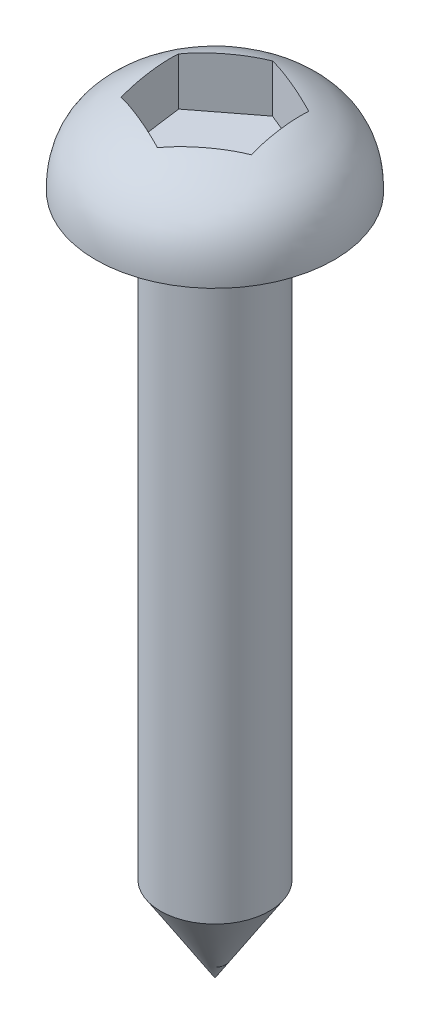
from build123d import *

# Parameters (mm, degrees)
ESQUISSE1_R             = 1.6
EXTRUSION1_DEPTH        = 20
CHANFREIN1_SIZE         = 1.6
CHANFREIN1_SIZE2        = 2.5
ENL_V_MAT_EXTRU_1_DEPTH = 2


with BuildPart() as part:
    # Esquisse1 → Extrusion1 (new body)
    with BuildSketch(Plane(origin=(0, 6.4, 0), x_dir=(-1, 0, 0), z_dir=(0, 1, 0))):
        with Locations(Location((0, 0, 0), (0, 0, 90))):
            Circle(ESQUISSE1_R)
    extrude(amount=-EXTRUSION1_DEPTH)

    # Esquisse2 → R_volution1 (revolve)
    with BuildSketch(Plane.XY):
        with BuildLine():
            Line((0, 6.4), (-3.5, 6.4))
            add(Edge.make_bspline(
                [(-3.5, 6.4), (-3.513618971, 7.67125323), (-2.831770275, 8.13342718), (-1.694692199, 8.774855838), (-1.236726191, 8.83535605), (0, 8.85)],
                knots=[0, 0, 0, 0, 0.491354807, 0.491354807, 1, 1, 1, 1], degree=3))
            Line((0, 8.85), (0, 6.4))
        make_face()
    revolve(axis=Axis((0, 9.434279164, 0), (0, -1, 0)))

    # Chanfrein1
    chanfrein1_edges = [part.edges().sort_by_distance(p)[0] for p in [
        (0, -13.6, -1.6),
    ]]
    chanfrein1_side = [part.faces().sort_by_distance(p)[0] for p in [
        (0, -13.6, 0),
    ]]
    chamfer(chanfrein1_edges, length=CHANFREIN1_SIZE, length2=CHANFREIN1_SIZE2, reference=chanfrein1_side[0])

    # Esquisse4 → Enl_v. mat.-Extru.1 (cut)
    with BuildSketch(Plane(origin=(0, 7.2, 0), x_dir=(-1, 0, 0), z_dir=(0, 1, 0))):
        Polygon((-1.814263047, 0.7495218), (-1.556236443, -1.196436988), (0.258026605, -1.945958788), (1.814263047, -0.7495218), (1.556236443, 1.196436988), (-0.258026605, 1.945958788), align=None)
    extrude(amount=ENL_V_MAT_EXTRU_1_DEPTH, mode=Mode.SUBTRACT)


solid = part.part
